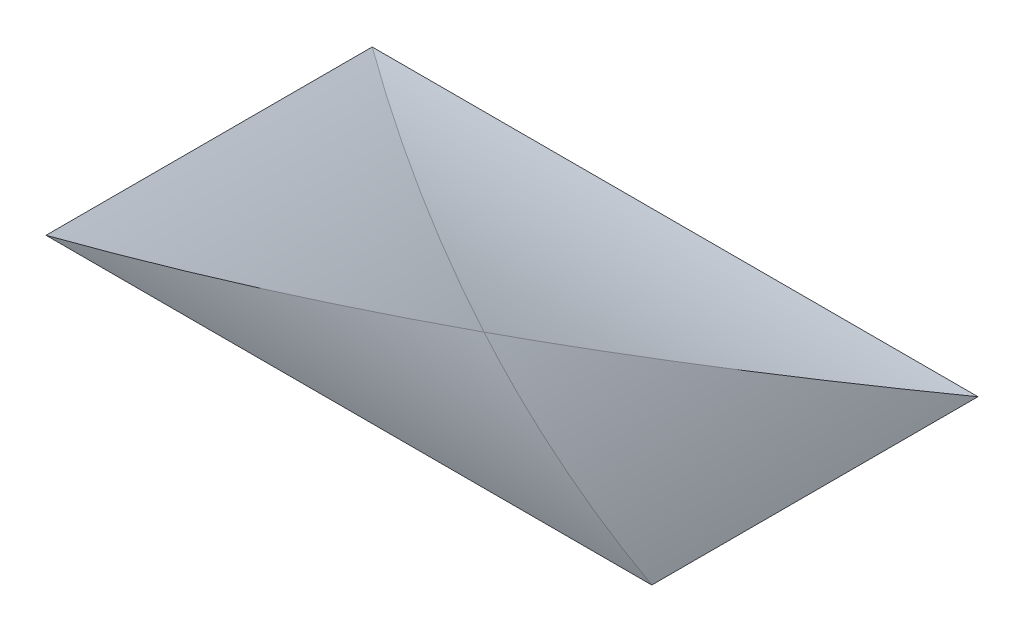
ISO-10303-21;
HEADER;
FILE_DESCRIPTION(('STEP AP214'),'2;1');
FILE_NAME('part.step','',(''),(''),'','','');
FILE_SCHEMA(('AUTOMOTIVE_DESIGN { 1 0 10303 214 1 1 1 1 }'));
ENDSEC;
DATA;
#1=APPLICATION_CONTEXT('core data for automotive mechanical design processes');
#2=APPLICATION_PROTOCOL_DEFINITION('international standard','automotive_design',2000,#1);
#3=PRODUCT_CONTEXT('',#1,'mechanical');
#4=PRODUCT('Part','Part','',(#3));
#5=PRODUCT_RELATED_PRODUCT_CATEGORY('part','',(#4));
#6=PRODUCT_DEFINITION_FORMATION('','',#4);
#7=PRODUCT_DEFINITION_CONTEXT('part definition',#1,'design');
#8=PRODUCT_DEFINITION('design','',#6,#7);
#9=PRODUCT_DEFINITION_SHAPE('','',#8);
#10=(LENGTH_UNIT() NAMED_UNIT(*) SI_UNIT(.MILLI.,.METRE.));
#11=(NAMED_UNIT(*) PLANE_ANGLE_UNIT() SI_UNIT($,.RADIAN.));
#12=(NAMED_UNIT(*) SI_UNIT($,.STERADIAN.) SOLID_ANGLE_UNIT());
#13=UNCERTAINTY_MEASURE_WITH_UNIT(LENGTH_MEASURE(1.E-05),#10,'distance_accuracy_value','');
#14=(GEOMETRIC_REPRESENTATION_CONTEXT(3) GLOBAL_UNCERTAINTY_ASSIGNED_CONTEXT((#13)) GLOBAL_UNIT_ASSIGNED_CONTEXT((#10,
#11,#12)) REPRESENTATION_CONTEXT('',''));
#15=CARTESIAN_POINT('',(0.,0.,0.));
#16=DIRECTION('',(0.,0.,1.));
#17=DIRECTION('',(1.,0.,0.));
#18=AXIS2_PLACEMENT_3D('',#15,#16,#17);
#19=CARTESIAN_POINT('',(650.,-1.11022302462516E-13,0.));
#20=DIRECTION('',(0.,0.,1.));
#21=DIRECTION('',(1.,0.,0.));
#22=AXIS2_PLACEMENT_3D('',#19,#20,#21);
#23=PLANE('',#22);
#24=DIRECTION('',(1.,0.,0.));
#25=VECTOR('',#24,1.);
#26=CARTESIAN_POINT('',(0.,0.,0.));
#27=LINE('',#26,#25);
#28=CARTESIAN_POINT('',(0.,0.,0.));
#29=VERTEX_POINT('',#28);
#30=CARTESIAN_POINT('',(650.,0.,0.));
#31=VERTEX_POINT('',#30);
#32=EDGE_CURVE('E111',#29,#31,#27,.T.);
#33=ORIENTED_EDGE('',*,*,#32,.F.);
#34=DIRECTION('',(-0.707106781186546,-0.707106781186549,0.));
#35=VECTOR('',#34,1.);
#36=CARTESIAN_POINT('',(0.,0.,0.));
#37=LINE('',#36,#35);
#38=CARTESIAN_POINT('',(349.999999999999,350.,0.));
#39=VERTEX_POINT('',#38);
#40=EDGE_CURVE('E13',#39,#29,#37,.T.);
#41=ORIENTED_EDGE('',*,*,#40,.F.);
#42=DIRECTION('',(-1.,0.,0.));
#43=VECTOR('',#42,1.);
#44=CARTESIAN_POINT('',(349.999999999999,350.,0.));
#45=LINE('',#44,#43);
#46=CARTESIAN_POINT('',(999.999999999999,350.,0.));
#47=VERTEX_POINT('',#46);
#48=EDGE_CURVE('E70',#47,#39,#45,.T.);
#49=ORIENTED_EDGE('',*,*,#48,.F.);
#50=DIRECTION('',(0.707106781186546,0.707106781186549,0.));
#51=VECTOR('',#50,1.);
#52=CARTESIAN_POINT('',(650.,0.,0.));
#53=LINE('',#52,#51);
#54=EDGE_CURVE('E78',#31,#47,#53,.T.);
#55=ORIENTED_EDGE('',*,*,#54,.F.);
#56=EDGE_LOOP('',(#33,#41,#49,#55));
#57=FACE_BOUND('',#56,.T.);
#58=ADVANCED_FACE('F55',(#57),#23,.F.);
#59=CARTESIAN_POINT('',(999.999999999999,350.,0.));
#60=CARTESIAN_POINT('',(993.303920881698,347.689202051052,0.799983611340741));
#61=CARTESIAN_POINT('',(979.915292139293,343.06490190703,2.36795148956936));
#62=CARTESIAN_POINT('',(959.84251396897,336.120663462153,4.62390527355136));
#63=CARTESIAN_POINT('',(939.779477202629,329.168961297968,6.78386102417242));
#64=CARTESIAN_POINT('',(919.725758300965,322.21011992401,8.84781874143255));
#65=CARTESIAN_POINT('',(899.680933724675,315.244463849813,10.8157784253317));
#66=CARTESIAN_POINT('',(879.644579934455,308.272317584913,12.68774007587));
#67=CARTESIAN_POINT('',(859.616273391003,301.294005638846,14.4637036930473));
#68=CARTESIAN_POINT('',(839.595590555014,294.309852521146,16.1436692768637));
#69=CARTESIAN_POINT('',(819.582107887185,287.320182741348,17.7276368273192));
#70=CARTESIAN_POINT('',(799.575401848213,280.325320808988,19.2156063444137));
#71=CARTESIAN_POINT('',(779.575048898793,273.325591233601,20.6075778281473));
#72=CARTESIAN_POINT('',(759.580625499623,266.321318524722,21.9035512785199));
#73=CARTESIAN_POINT('',(739.591708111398,259.312827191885,23.1035266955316));
#74=CARTESIAN_POINT('',(719.607873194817,252.300441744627,24.2075040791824));
#75=CARTESIAN_POINT('',(699.628697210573,245.284486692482,25.2154834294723));
#76=CARTESIAN_POINT('',(679.653756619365,238.265286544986,26.1274647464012));
#77=CARTESIAN_POINT('',(659.682627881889,231.243165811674,26.9434480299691));
#78=CARTESIAN_POINT('',(639.714887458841,224.21844900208,27.6634332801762));
#79=CARTESIAN_POINT('',(619.750111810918,217.19146062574,28.2874204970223));
#80=CARTESIAN_POINT('',(599.787877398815,210.162525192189,28.8154096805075));
#81=CARTESIAN_POINT('',(579.827760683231,203.131967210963,29.2474008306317));
#82=CARTESIAN_POINT('',(559.86933812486,196.100111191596,29.583393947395));
#83=CARTESIAN_POINT('',(539.912186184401,189.067281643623,29.8233890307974));
#84=CARTESIAN_POINT('',(519.955881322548,182.03380307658,29.9673860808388));
#85=CARTESIAN_POINT('',(506.651960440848,177.344601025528,29.9993854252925));
#86=CARTESIAN_POINT('',(499.999999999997,175.000000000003,29.9992063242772));
#87=CARTESIAN_POINT('',(945.833333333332,350.,0.));
#88=CARTESIAN_POINT('',(939.859099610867,347.690623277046,0.799983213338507));
#89=CARTESIAN_POINT('',(927.914206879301,343.068995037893,2.3679503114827));
#90=CARTESIAN_POINT('',(910.007162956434,336.128273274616,4.62390297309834));
#91=CARTESIAN_POINT('',(892.109985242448,329.179617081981,6.78385764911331));
#92=CARTESIAN_POINT('',(874.222244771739,322.223371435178,8.84781433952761));
#93=CARTESIAN_POINT('',(856.343512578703,315.259881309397,10.8157730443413));
#94=CARTESIAN_POINT('',(838.473359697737,308.289491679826,12.6877337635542));
#95=CARTESIAN_POINT('',(820.611357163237,301.312547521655,14.4636964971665));
#96=CARTESIAN_POINT('',(802.7570760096,294.329393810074,16.1436612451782));
#97=CARTESIAN_POINT('',(784.910087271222,287.340375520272,17.7276280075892));
#98=CARTESIAN_POINT('',(767.0699619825,280.345837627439,19.2155967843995));
#99=CARTESIAN_POINT('',(749.236271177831,273.346125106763,20.6075675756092));
#100=CARTESIAN_POINT('',(731.40858589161,266.341582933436,21.9035403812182));
#101=CARTESIAN_POINT('',(713.586477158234,259.332556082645,23.1035152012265));
#102=CARTESIAN_POINT('',(695.769516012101,252.31938952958,24.2074920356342));
#103=CARTESIAN_POINT('',(677.957273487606,245.302428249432,25.2154708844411));
#104=CARTESIAN_POINT('',(660.149320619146,238.282017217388,26.1274517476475));
#105=CARTESIAN_POINT('',(642.345228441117,231.25850140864,26.9434346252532));
#106=CARTESIAN_POINT('',(624.544567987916,224.232225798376,27.6634195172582));
#107=CARTESIAN_POINT('',(606.746910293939,217.203535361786,28.2874064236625));
#108=CARTESIAN_POINT('',(588.951826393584,210.172775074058,28.8153953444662));
#109=CARTESIAN_POINT('',(571.158887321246,203.140289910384,29.2473862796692));
#110=CARTESIAN_POINT('',(553.367664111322,196.106424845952,29.5833792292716));
#111=CARTESIAN_POINT('',(535.577727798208,189.071524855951,29.8233741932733));
#112=CARTESIAN_POINT('',(517.788649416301,182.035934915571,29.9673711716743));
#113=CARTESIAN_POINT('',(505.929549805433,177.345311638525,29.9993705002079));
#114=CARTESIAN_POINT('',(499.999999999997,175.000000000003,29.9992063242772));
#115=CARTESIAN_POINT('',(837.5,350.,0.));
#116=CARTESIAN_POINT('',(832.969457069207,347.693465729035,0.79998241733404));
#117=CARTESIAN_POINT('',(823.912036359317,343.077181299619,2.36794795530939));
#118=CARTESIAN_POINT('',(810.336460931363,336.143492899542,4.62389837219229));
#119=CARTESIAN_POINT('',(796.771001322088,329.200928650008,6.78385089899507));
#120=CARTESIAN_POINT('',(783.215217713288,322.249874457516,8.84780553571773));
#121=CARTESIAN_POINT('',(769.66867028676,315.290716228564,10.8157622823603));
#122=CARTESIAN_POINT('',(756.1309192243,308.323839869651,12.6877211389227));
#123=CARTESIAN_POINT('',(742.601524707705,301.349631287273,14.463682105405));
#124=CARTESIAN_POINT('',(729.080046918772,294.36847638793,16.1436451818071));
#125=CARTESIAN_POINT('',(715.566046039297,287.38076107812,17.7276103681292));
#126=CARTESIAN_POINT('',(702.059082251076,280.38687126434,19.2155776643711));
#127=CARTESIAN_POINT('',(688.558715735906,273.387192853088,20.6075470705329));
#128=CARTESIAN_POINT('',(675.064506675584,266.382111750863,21.9035185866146));
#129=CARTESIAN_POINT('',(661.576015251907,259.372013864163,23.1034922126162));
#130=CARTESIAN_POINT('',(648.092801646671,252.357285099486,24.2074679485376));
#131=CARTESIAN_POINT('',(634.614426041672,245.33831136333,25.2154457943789));
#132=CARTESIAN_POINT('',(621.140448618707,238.315478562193,26.1274257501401));
#133=CARTESIAN_POINT('',(607.670429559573,231.289172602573,26.9434078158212));
#134=CARTESIAN_POINT('',(594.203929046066,224.259779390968,27.6633919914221));
#135=CARTESIAN_POINT('',(580.740507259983,217.227684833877,28.287378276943));
#136=CARTESIAN_POINT('',(567.279724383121,210.193274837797,28.8153666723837));
#137=CARTESIAN_POINT('',(553.821140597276,203.156935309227,29.2473571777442));
#138=CARTESIAN_POINT('',(540.364316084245,196.119052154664,29.5833497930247));
#139=CARTESIAN_POINT('',(526.908811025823,189.080011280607,29.823344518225));
#140=CARTESIAN_POINT('',(513.454185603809,182.040198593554,29.9673413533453));
#141=CARTESIAN_POINT('',(504.484728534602,177.346732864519,29.9993406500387));
#142=CARTESIAN_POINT('',(499.999999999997,175.000000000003,29.9992063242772));
#143=CARTESIAN_POINT('',(674.999999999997,350.,0.));
#144=CARTESIAN_POINT('',(672.634993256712,347.697729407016,0.799981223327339));
#145=CARTESIAN_POINT('',(667.908780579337,343.089460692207,2.36794442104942));
#146=CARTESIAN_POINT('',(660.830407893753,336.166322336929,4.62389147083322));
#147=CARTESIAN_POINT('',(653.762525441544,329.232896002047,6.78384077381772));
#148=CARTESIAN_POINT('',(646.704677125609,322.289628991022,8.84779233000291));
#149=CARTESIAN_POINT('',(639.656406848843,315.336968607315,10.8157461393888));
#150=CARTESIAN_POINT('',(632.617258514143,308.375362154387,12.6877022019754));
#151=CARTESIAN_POINT('',(625.586776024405,301.4052569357,14.4636605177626));
#152=CARTESIAN_POINT('',(618.564503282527,294.427100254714,16.1436210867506));
#153=CARTESIAN_POINT('',(611.549984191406,287.441339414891,17.7275839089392));
#154=CARTESIAN_POINT('',(604.542762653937,280.448421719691,19.2155489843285));
#155=CARTESIAN_POINT('',(597.542382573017,273.448794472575,20.6075163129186));
#156=CARTESIAN_POINT('',(590.548387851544,266.442904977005,21.9034858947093));
#157=CARTESIAN_POINT('',(583.560322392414,259.431200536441,23.1034577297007));
#158=CARTESIAN_POINT('',(576.577730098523,252.414128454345,24.2074318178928));
#159=CARTESIAN_POINT('',(569.600154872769,245.392136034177,25.2154081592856));
#160=CARTESIAN_POINT('',(562.627140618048,238.365670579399,26.127386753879));
#161=CARTESIAN_POINT('',(555.658231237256,231.335179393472,26.9433676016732));
#162=CARTESIAN_POINT('',(548.692970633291,224.301109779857,27.6633507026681));
#163=CARTESIAN_POINT('',(541.730902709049,217.263909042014,28.2873360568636));
#164=CARTESIAN_POINT('',(534.771571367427,210.224024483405,28.8153236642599));
#165=CARTESIAN_POINT('',(527.814520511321,203.181903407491,29.2473135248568));
#166=CARTESIAN_POINT('',(520.859294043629,196.137993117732,29.5833056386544));
#167=CARTESIAN_POINT('',(513.905435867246,189.092740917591,29.8233000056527));
#168=CARTESIAN_POINT('',(506.95248988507,182.046594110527,29.9672966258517));
#169=CARTESIAN_POINT('',(502.317496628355,177.348864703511,29.9992958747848));
#170=CARTESIAN_POINT('',(499.999999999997,175.000000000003,29.9992063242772));
#171=CARTESIAN_POINT('',(512.499999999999,350.,0.));
#172=CARTESIAN_POINT('',(512.300529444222,347.701993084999,0.799980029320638));
#173=CARTESIAN_POINT('',(511.905524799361,343.101740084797,2.36794088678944));
#174=CARTESIAN_POINT('',(511.324354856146,336.189151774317,4.62388456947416));
#175=CARTESIAN_POINT('',(510.754049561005,329.264863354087,6.78383064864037));
#176=CARTESIAN_POINT('',(510.194136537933,322.329383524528,8.84777912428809));
#177=CARTESIAN_POINT('',(509.644143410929,315.383220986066,10.8157299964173));
#178=CARTESIAN_POINT('',(509.103597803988,308.426884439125,12.687683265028));
#179=CARTESIAN_POINT('',(508.572027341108,301.460882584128,14.4636389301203));
#180=CARTESIAN_POINT('',(508.048959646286,294.485724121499,16.143596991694));
#181=CARTESIAN_POINT('',(507.533922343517,287.501917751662,17.7275574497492));
#182=CARTESIAN_POINT('',(507.0264430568,280.509972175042,19.215520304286));
#183=CARTESIAN_POINT('',(506.526049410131,273.510396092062,20.6074855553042));
#184=CARTESIAN_POINT('',(506.032269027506,266.503698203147,21.903453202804));
#185=CARTESIAN_POINT('',(505.544629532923,259.490387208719,23.1034232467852));
#186=CARTESIAN_POINT('',(505.062658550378,252.470971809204,24.207395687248));
#187=CARTESIAN_POINT('',(504.585883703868,245.445960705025,25.2153705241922));
#188=CARTESIAN_POINT('',(504.11383261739,238.415862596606,26.127347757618));
#189=CARTESIAN_POINT('',(503.64603291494,231.381186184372,26.9433273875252));
#190=CARTESIAN_POINT('',(503.182012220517,224.342440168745,27.663309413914));
#191=CARTESIAN_POINT('',(502.721298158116,217.300133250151,28.2872938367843));
#192=CARTESIAN_POINT('',(502.263418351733,210.254774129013,28.8152806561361));
#193=CARTESIAN_POINT('',(501.807900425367,203.206871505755,29.2472698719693));
#194=CARTESIAN_POINT('',(501.354272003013,196.156934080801,29.5832614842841));
#195=CARTESIAN_POINT('',(500.902060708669,189.105470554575,29.8232554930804));
#196=CARTESIAN_POINT('',(500.450794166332,182.052989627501,29.9672518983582));
#197=CARTESIAN_POINT('',(500.150264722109,177.350996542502,29.999251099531));
#198=CARTESIAN_POINT('',(499.999999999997,175.000000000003,29.9992063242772));
#199=CARTESIAN_POINT('',(404.166666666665,350.,0.));
#200=CARTESIAN_POINT('',(405.41088690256,347.704835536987,0.79997923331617));
#201=CARTESIAN_POINT('',(407.903354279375,343.109926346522,2.36793853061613));
#202=CARTESIAN_POINT('',(411.653652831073,336.204371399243,4.62387996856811));
#203=CARTESIAN_POINT('',(415.415065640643,329.286174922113,6.78382389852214));
#204=CARTESIAN_POINT('',(419.187109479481,322.355886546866,8.84777032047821));
#205=CARTESIAN_POINT('',(422.969301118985,315.414055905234,10.8157192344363));
#206=CARTESIAN_POINT('',(426.76115733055,308.461232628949,12.6876706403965));
#207=CARTESIAN_POINT('',(430.562194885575,301.497966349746,14.4636245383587));
#208=CARTESIAN_POINT('',(434.371930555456,294.524806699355,16.143580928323));
#209=CARTESIAN_POINT('',(438.189881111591,287.54230330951,17.7275398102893));
#210=CARTESIAN_POINT('',(442.015563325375,280.551005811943,19.2155011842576));
#211=CARTESIAN_POINT('',(445.848493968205,273.551463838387,20.607465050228));
#212=CARTESIAN_POINT('',(449.68818981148,266.544227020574,21.9034314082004));
#213=CARTESIAN_POINT('',(453.534167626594,259.529844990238,23.1034002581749));
#214=CARTESIAN_POINT('',(457.385944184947,252.50886737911,24.2073716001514));
#215=CARTESIAN_POINT('',(461.243036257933,245.481843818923,25.21534543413));
#216=CARTESIAN_POINT('',(465.104960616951,238.449323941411,26.1273217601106));
#217=CARTESIAN_POINT('',(468.971234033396,231.411857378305,26.9433005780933));
#218=CARTESIAN_POINT('',(472.841373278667,224.369993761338,27.663281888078));
#219=CARTESIAN_POINT('',(476.714895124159,217.324282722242,28.2872656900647));
#220=CARTESIAN_POINT('',(480.59131634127,210.275273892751,28.8152519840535));
#221=CARTESIAN_POINT('',(484.470153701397,203.223516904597,29.2472407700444));
#222=CARTESIAN_POINT('',(488.350923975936,196.169561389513,29.5832320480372));
#223=CARTESIAN_POINT('',(492.233143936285,189.113956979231,29.8232258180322));
#224=CARTESIAN_POINT('',(496.116330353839,182.057253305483,29.9672220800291));
#225=CARTESIAN_POINT('',(498.705443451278,177.352417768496,29.9992212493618));
#226=CARTESIAN_POINT('',(499.999999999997,175.000000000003,29.9992063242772));
#227=CARTESIAN_POINT('',(349.999999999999,350.,0.));
#228=CARTESIAN_POINT('',(351.966065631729,347.706256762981,0.799978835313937));
#229=CARTESIAN_POINT('',(355.902269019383,343.114019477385,2.36793735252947));
#230=CARTESIAN_POINT('',(361.818301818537,336.211981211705,4.62387766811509));
#231=CARTESIAN_POINT('',(367.745573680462,329.296830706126,6.78382052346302));
#232=CARTESIAN_POINT('',(373.683595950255,322.369138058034,8.84776591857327));
#233=CARTESIAN_POINT('',(379.631879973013,315.429473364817,10.8157138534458));
#234=CARTESIAN_POINT('',(385.589937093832,308.478406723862,12.6876643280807));
#235=CARTESIAN_POINT('',(391.557278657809,301.516508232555,14.4636173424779));
#236=CARTESIAN_POINT('',(397.533416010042,294.544347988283,16.1435728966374));
#237=CARTESIAN_POINT('',(403.517860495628,287.562496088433,17.7275309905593));
#238=CARTESIAN_POINT('',(409.510123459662,280.571522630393,19.2154916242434));
#239=CARTESIAN_POINT('',(415.509716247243,273.571997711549,20.6074547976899));
#240=CARTESIAN_POINT('',(421.516150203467,266.564491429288,21.9034205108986));
#241=CARTESIAN_POINT('',(427.52893667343,259.549573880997,23.1033887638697));
#242=CARTESIAN_POINT('',(433.547587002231,252.527815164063,24.2073595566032));
#243=CARTESIAN_POINT('',(439.571612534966,245.499785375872,25.2153328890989));
#244=CARTESIAN_POINT('',(445.600524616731,238.466054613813,26.1273087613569));
#245=CARTESIAN_POINT('',(451.633834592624,231.427192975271,26.9432871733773));
#246=CARTESIAN_POINT('',(457.671053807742,224.383770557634,27.66326812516));
#247=CARTESIAN_POINT('',(463.711693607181,217.336357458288,28.2872516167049));
#248=CARTESIAN_POINT('',(469.755265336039,210.285523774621,28.8152376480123));
#249=CARTESIAN_POINT('',(475.801280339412,203.231839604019,29.2472262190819));
#250=CARTESIAN_POINT('',(481.849249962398,196.175875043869,29.5832173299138));
#251=CARTESIAN_POINT('',(487.898685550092,189.118200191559,29.8232109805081));
#252=CARTESIAN_POINT('',(493.949098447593,182.059385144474,29.9672071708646));
#253=CARTESIAN_POINT('',(497.983032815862,177.353128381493,29.9992063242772));
#254=CARTESIAN_POINT('',(499.999999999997,175.000000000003,29.9992063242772));
#255=B_SPLINE_SURFACE_WITH_KNOTS('',3,3,((#59,#60,#61,#62,#63,#64,#65,#66,#67,#68,#69,#70,#71,
#72,#73,#74,#75,#76,#77,#78,#79,#80,#81,#82,#83,#84,#85,#86),(#87,#88,#89,#90,#91,#92,#93,#94,
#95,#96,#97,#98,#99,#100,#101,#102,#103,#104,#105,#106,#107,#108,#109,#110,#111,#112,#113,#114),
(#115,#116,#117,#118,#119,#120,#121,#122,#123,#124,#125,#126,#127,#128,#129,#130,#131,#132,#133,
#134,#135,#136,#137,#138,#139,#140,#141,#142),(#143,#144,#145,#146,#147,#148,#149,#150,#151,
#152,#153,#154,#155,#156,#157,#158,#159,#160,#161,#162,#163,#164,#165,#166,#167,#168,#169,#170),
(#171,#172,#173,#174,#175,#176,#177,#178,#179,#180,#181,#182,#183,#184,#185,#186,#187,#188,#189,
#190,#191,#192,#193,#194,#195,#196,#197,#198),(#199,#200,#201,#202,#203,#204,#205,#206,#207,
#208,#209,#210,#211,#212,#213,#214,#215,#216,#217,#218,#219,#220,#221,#222,#223,#224,#225,#226),
(#227,#228,#229,#230,#231,#232,#233,#234,#235,#236,#237,#238,#239,#240,#241,#242,#243,#244,#245,
#246,#247,#248,#249,#250,#251,#252,#253,#254)),.UNSPECIFIED.,.F.,.F.,.F.,(4,1,1,1,4),(4,1,1,1,1,
1,1,1,1,1,1,1,1,1,1,1,1,1,1,1,1,1,1,1,1,4),(0.637877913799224,0.728408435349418,
0.818938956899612,0.909469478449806,1.),(0.,0.04,0.08,0.12,0.16,0.2,0.24,0.28,0.32,0.36,0.4,
0.44,0.48,0.52,0.56,0.6,0.64,0.68,0.72,0.76,0.8,0.84,0.88,0.92,0.96,1.),.UNSPECIFIED.);
#256=CARTESIAN_POINT('',(349.999999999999,350.,0.));
#257=CARTESIAN_POINT('',(351.966065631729,347.706256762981,0.799978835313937));
#258=CARTESIAN_POINT('',(355.902269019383,343.114019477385,2.36793735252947));
#259=CARTESIAN_POINT('',(361.818301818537,336.211981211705,4.62387766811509));
#260=CARTESIAN_POINT('',(367.745573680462,329.296830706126,6.78382052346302));
#261=CARTESIAN_POINT('',(373.683595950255,322.369138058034,8.84776591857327));
#262=CARTESIAN_POINT('',(379.631879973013,315.429473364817,10.8157138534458));
#263=CARTESIAN_POINT('',(385.589937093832,308.478406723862,12.6876643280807));
#264=CARTESIAN_POINT('',(391.557278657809,301.516508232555,14.4636173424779));
#265=CARTESIAN_POINT('',(397.533416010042,294.544347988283,16.1435728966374));
#266=CARTESIAN_POINT('',(403.517860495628,287.562496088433,17.7275309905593));
#267=CARTESIAN_POINT('',(409.510123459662,280.571522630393,19.2154916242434));
#268=CARTESIAN_POINT('',(415.509716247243,273.571997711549,20.6074547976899));
#269=CARTESIAN_POINT('',(421.516150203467,266.564491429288,21.9034205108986));
#270=CARTESIAN_POINT('',(427.52893667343,259.549573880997,23.1033887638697));
#271=CARTESIAN_POINT('',(433.547587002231,252.527815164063,24.2073595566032));
#272=CARTESIAN_POINT('',(439.571612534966,245.499785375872,25.2153328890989));
#273=CARTESIAN_POINT('',(445.600524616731,238.466054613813,26.1273087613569));
#274=CARTESIAN_POINT('',(451.633834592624,231.427192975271,26.9432871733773));
#275=CARTESIAN_POINT('',(457.671053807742,224.383770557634,27.66326812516));
#276=CARTESIAN_POINT('',(463.711693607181,217.336357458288,28.2872516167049));
#277=CARTESIAN_POINT('',(469.755265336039,210.285523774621,28.8152376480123));
#278=CARTESIAN_POINT('',(475.801280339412,203.231839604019,29.2472262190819));
#279=CARTESIAN_POINT('',(481.849249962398,196.175875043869,29.5832173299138));
#280=CARTESIAN_POINT('',(487.898685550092,189.118200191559,29.8232109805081));
#281=CARTESIAN_POINT('',(493.949098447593,182.059385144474,29.9672071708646));
#282=CARTESIAN_POINT('',(497.983032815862,177.353128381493,29.9992063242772));
#283=CARTESIAN_POINT('',(499.999999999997,175.000000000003,29.9992063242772));
#284=B_SPLINE_CURVE_WITH_KNOTS('',3,(#256,#257,#258,#259,#260,#261,#262,#263,#264,#265,#266,
#267,#268,#269,#270,#271,#272,#273,#274,#275,#276,#277,#278,#279,#280,#281,#282,#283),
.UNSPECIFIED.,.F.,.F.,(4,1,1,1,1,1,1,1,1,1,1,1,1,1,1,1,1,1,1,1,1,1,1,1,1,4),(0.,0.04,0.08,0.12,
0.16,0.2,0.24,0.28,0.32,0.36,0.4,0.44,0.48,0.52,0.56,0.6,0.64,0.68,0.72,0.76,0.8,0.84,0.88,0.92,
0.96,1.),.UNSPECIFIED.);
#285=CARTESIAN_POINT('',(499.999999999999,175.000000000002,29.9994536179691));
#286=VERTEX_POINT('',#285);
#287=EDGE_CURVE('E97',#39,#286,#284,.T.);
#288=CARTESIAN_POINT('',(999.999999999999,350.,0.));
#289=CARTESIAN_POINT('',(993.303920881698,347.689202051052,0.799983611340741));
#290=CARTESIAN_POINT('',(979.915292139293,343.06490190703,2.36795148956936));
#291=CARTESIAN_POINT('',(959.84251396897,336.120663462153,4.62390527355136));
#292=CARTESIAN_POINT('',(939.779477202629,329.168961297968,6.78386102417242));
#293=CARTESIAN_POINT('',(919.725758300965,322.21011992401,8.84781874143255));
#294=CARTESIAN_POINT('',(899.680933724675,315.244463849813,10.8157784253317));
#295=CARTESIAN_POINT('',(879.644579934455,308.272317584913,12.68774007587));
#296=CARTESIAN_POINT('',(859.616273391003,301.294005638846,14.4637036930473));
#297=CARTESIAN_POINT('',(839.595590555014,294.309852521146,16.1436692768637));
#298=CARTESIAN_POINT('',(819.582107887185,287.320182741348,17.7276368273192));
#299=CARTESIAN_POINT('',(799.575401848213,280.325320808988,19.2156063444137));
#300=CARTESIAN_POINT('',(779.575048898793,273.325591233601,20.6075778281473));
#301=CARTESIAN_POINT('',(759.580625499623,266.321318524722,21.9035512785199));
#302=CARTESIAN_POINT('',(739.591708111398,259.312827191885,23.1035266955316));
#303=CARTESIAN_POINT('',(719.607873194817,252.300441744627,24.2075040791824));
#304=CARTESIAN_POINT('',(699.628697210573,245.284486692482,25.2154834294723));
#305=CARTESIAN_POINT('',(679.653756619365,238.265286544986,26.1274647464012));
#306=CARTESIAN_POINT('',(659.682627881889,231.243165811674,26.9434480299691));
#307=CARTESIAN_POINT('',(639.714887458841,224.21844900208,27.6634332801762));
#308=CARTESIAN_POINT('',(619.750111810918,217.19146062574,28.2874204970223));
#309=CARTESIAN_POINT('',(599.787877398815,210.162525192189,28.8154096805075));
#310=CARTESIAN_POINT('',(579.827760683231,203.131967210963,29.2474008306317));
#311=CARTESIAN_POINT('',(559.86933812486,196.100111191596,29.583393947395));
#312=CARTESIAN_POINT('',(539.912186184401,189.067281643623,29.8233890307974));
#313=CARTESIAN_POINT('',(519.955881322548,182.03380307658,29.9673860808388));
#314=CARTESIAN_POINT('',(506.651960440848,177.344601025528,29.9993854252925));
#315=CARTESIAN_POINT('',(499.999999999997,175.000000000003,29.9992063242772));
#316=B_SPLINE_CURVE_WITH_KNOTS('',3,(#288,#289,#290,#291,#292,#293,#294,#295,#296,#297,#298,
#299,#300,#301,#302,#303,#304,#305,#306,#307,#308,#309,#310,#311,#312,#313,#314,#315),
.UNSPECIFIED.,.F.,.F.,(4,1,1,1,1,1,1,1,1,1,1,1,1,1,1,1,1,1,1,1,1,1,1,1,1,4),(0.,0.04,0.08,0.12,
0.16,0.2,0.24,0.28,0.32,0.36,0.4,0.44,0.48,0.52,0.56,0.6,0.64,0.68,0.72,0.76,0.8,0.84,0.88,0.92,
0.96,1.),.UNSPECIFIED.);
#317=EDGE_CURVE('E109',#47,#286,#316,.T.);
#318=ORIENTED_EDGE('',*,*,#48,.T.);
#319=ORIENTED_EDGE('',*,*,#287,.T.);
#320=ORIENTED_EDGE('',*,*,#317,.F.);
#321=EDGE_LOOP('',(#318,#319,#320));
#322=FACE_BOUND('',#321,.T.);
#323=ADVANCED_FACE('F108',(#322),#255,.T.);
#324=CARTESIAN_POINT('',(650.,0.,0.));
#325=CARTESIAN_POINT('',(647.974030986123,2.34288156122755,0.799987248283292));
#326=CARTESIAN_POINT('',(643.925209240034,7.02749889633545,2.36796225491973));
#327=CARTESIAN_POINT('',(637.860951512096,14.0511250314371,4.62392629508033));
#328=CARTESIAN_POINT('',(631.805294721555,21.0715887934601,6.78389186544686));
#329=CARTESIAN_POINT('',(625.75786491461,28.0890276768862,8.84785896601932));
#330=CARTESIAN_POINT('',(619.718288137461,35.1035791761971,10.8158275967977));
#331=CARTESIAN_POINT('',(613.686190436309,42.1153807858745,12.687797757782));
#332=CARTESIAN_POINT('',(607.661197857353,49.1245700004,14.4637694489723));
#333=CARTESIAN_POINT('',(601.642936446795,56.1312843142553,16.1437426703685));
#334=CARTESIAN_POINT('',(595.631032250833,63.135661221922,17.7277174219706));
#335=CARTESIAN_POINT('',(589.62511131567,70.137838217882,19.2156937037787));
#336=CARTESIAN_POINT('',(583.624799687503,77.1379527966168,20.6076715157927));
#337=CARTESIAN_POINT('',(577.629723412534,84.1361424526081,21.9036508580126));
#338=CARTESIAN_POINT('',(571.639508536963,91.1325446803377,23.1036317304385));
#339=CARTESIAN_POINT('',(565.65378110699,98.127296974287,24.2076141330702));
#340=CARTESIAN_POINT('',(559.672167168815,105.120536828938,25.215598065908));
#341=CARTESIAN_POINT('',(553.694292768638,112.112401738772,26.1275835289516));
#342=CARTESIAN_POINT('',(547.71978395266,119.103029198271,26.9435705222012));
#343=CARTESIAN_POINT('',(541.74826676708,126.092556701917,27.6635590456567));
#344=CARTESIAN_POINT('',(535.7793672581,133.081121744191,28.2875490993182));
#345=CARTESIAN_POINT('',(529.812711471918,140.068861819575,28.8155406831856));
#346=CARTESIAN_POINT('',(523.847925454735,147.05591442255,29.2475337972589));
#347=CARTESIAN_POINT('',(517.884635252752,154.042417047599,29.5835284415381));
#348=CARTESIAN_POINT('',(511.922466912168,161.028507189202,29.8235246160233));
#349=CARTESIAN_POINT('',(505.961046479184,168.014322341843,29.9675223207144));
#350=CARTESIAN_POINT('',(501.987015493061,172.671440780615,29.9995218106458));
#351=CARTESIAN_POINT('',(499.999999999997,175.000000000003,29.9992063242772));
#352=CARTESIAN_POINT('',(679.166666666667,29.1666666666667,0.));
#353=CARTESIAN_POINT('',(676.751521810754,31.1217416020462,0.799986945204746));
#354=CARTESIAN_POINT('',(671.924382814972,35.0306158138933,2.3679613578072));
#355=CARTESIAN_POINT('',(664.692748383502,40.8902532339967,4.62392454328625));
#356=CARTESIAN_POINT('',(657.469809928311,46.7463698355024,6.78388929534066));
#357=CARTESIAN_POINT('',(650.255189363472,52.5991186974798,8.84785561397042));
#358=CARTESIAN_POINT('',(643.048508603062,58.4486528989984,10.8158234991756));
#359=CARTESIAN_POINT('',(635.849389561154,64.2951255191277,12.687792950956));
#360=CARTESIAN_POINT('',(628.657454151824,70.1386896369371,14.4637639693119));
#361=CARTESIAN_POINT('',(621.472324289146,75.9794983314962,16.1437365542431));
#362=CARTESIAN_POINT('',(614.293621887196,81.8177046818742,17.7277107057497));
#363=CARTESIAN_POINT('',(607.120968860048,87.6534617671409,19.2156864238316));
#364=CARTESIAN_POINT('',(599.953987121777,93.4869226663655,20.6076637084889));
#365=CARTESIAN_POINT('',(592.792298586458,99.3182404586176,21.9036425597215));
#366=CARTESIAN_POINT('',(585.635525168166,105.147568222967,23.1036229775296));
#367=CARTESIAN_POINT('',(578.483288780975,110.975059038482,24.2076049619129));
#368=CARTESIAN_POINT('',(571.335211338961,116.800865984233,25.2155885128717));
#369=CARTESIAN_POINT('',(564.190914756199,122.62514213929,26.1275736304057));
#370=CARTESIAN_POINT('',(557.050020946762,128.448040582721,26.9435603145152));
#371=CARTESIAN_POINT('',(549.912151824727,134.269714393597,27.6635485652));
#372=CARTESIAN_POINT('',(542.776929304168,140.090316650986,28.2875383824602));
#373=CARTESIAN_POINT('',(535.643975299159,145.910000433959,28.8155297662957));
#374=CARTESIAN_POINT('',(528.512911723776,151.728918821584,29.2475227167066));
#375=CARTESIAN_POINT('',(521.383360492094,157.547224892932,29.5835172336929));
#376=CARTESIAN_POINT('',(514.254943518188,163.365071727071,29.8235133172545));
#377=CARTESIAN_POINT('',(507.127282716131,169.182612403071,29.9675109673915));
#378=CARTESIAN_POINT('',(502.375760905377,173.060870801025,29.9995104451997));
#379=CARTESIAN_POINT('',(499.999999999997,175.000000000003,29.9992063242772));
#380=CARTESIAN_POINT('',(737.499999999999,87.4999999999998,0.));
#381=CARTESIAN_POINT('',(734.306503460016,88.6794616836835,0.799986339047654));
#382=CARTESIAN_POINT('',(727.922729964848,91.0368496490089,2.36795956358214));
#383=CARTESIAN_POINT('',(718.356342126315,94.568509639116,4.62392103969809));
#384=CARTESIAN_POINT('',(708.798840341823,98.095931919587,6.78388415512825));
#385=CARTESIAN_POINT('',(699.249838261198,101.619300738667,8.84784890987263));
#386=CARTESIAN_POINT('',(689.708949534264,105.138800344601,10.8158153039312));
#387=CARTESIAN_POINT('',(680.175787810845,108.654614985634,12.687783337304));
#388=CARTESIAN_POINT('',(670.649966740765,112.166928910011,14.4637530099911));
#389=CARTESIAN_POINT('',(661.131099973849,115.675926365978,16.1437243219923));
#390=CARTESIAN_POINT('',(651.618801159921,119.181791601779,17.7276972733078));
#391=CARTESIAN_POINT('',(642.112683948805,122.684708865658,19.2156718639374));
#392=CARTESIAN_POINT('',(632.612361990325,126.184862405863,20.6076480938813));
#393=CARTESIAN_POINT('',(623.117448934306,129.682436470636,21.9036259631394));
#394=CARTESIAN_POINT('',(613.627558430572,133.177615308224,23.1036054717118));
#395=CARTESIAN_POINT('',(604.142304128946,136.670583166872,24.2075866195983));
#396=CARTESIAN_POINT('',(594.661299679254,140.161524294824,25.215569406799));
#397=CARTESIAN_POINT('',(585.18415873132,143.650622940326,26.127553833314));
#398=CARTESIAN_POINT('',(575.710494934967,147.138063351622,26.9435398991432));
#399=CARTESIAN_POINT('',(566.23992194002,150.624029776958,27.6635276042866));
#400=CARTESIAN_POINT('',(556.772053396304,154.108706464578,28.2875169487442));
#401=CARTESIAN_POINT('',(547.306502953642,157.592277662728,28.815507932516));
#402=CARTESIAN_POINT('',(537.842884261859,161.074927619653,29.2475005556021));
#403=CARTESIAN_POINT('',(528.380810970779,164.556840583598,29.5834948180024));
#404=CARTESIAN_POINT('',(518.919896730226,168.038200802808,29.8234907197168));
#405=CARTESIAN_POINT('',(509.459755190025,171.519192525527,29.9674882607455));
#406=CARTESIAN_POINT('',(503.153251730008,173.839730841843,29.9994877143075));
#407=CARTESIAN_POINT('',(499.999999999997,175.000000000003,29.9992063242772));
#408=CARTESIAN_POINT('',(825.,175.,0.));
#409=CARTESIAN_POINT('',(820.638975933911,175.01604180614,0.799985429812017));
#410=CARTESIAN_POINT('',(811.920250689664,175.046200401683,2.36795687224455));
#411=CARTESIAN_POINT('',(798.851732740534,175.085894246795,4.62391578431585));
#412=CARTESIAN_POINT('',(785.792385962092,175.120275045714,6.78387644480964));
#413=CARTESIAN_POINT('',(772.741811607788,175.149573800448,8.84783885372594));
#414=CARTESIAN_POINT('',(759.699610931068,175.174021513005,10.8158030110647));
#415=CARTESIAN_POINT('',(746.665385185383,175.193849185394,12.687768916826));
#416=CARTESIAN_POINT('',(733.638735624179,175.209287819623,14.4637365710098));
#417=CARTESIAN_POINT('',(720.619263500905,175.220568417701,16.1437059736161));
#418=CARTESIAN_POINT('',(707.60657006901,175.227921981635,17.7276771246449));
#419=CARTESIAN_POINT('',(694.600256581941,175.231579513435,19.2156500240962));
#420=CARTESIAN_POINT('',(681.599924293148,175.231772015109,20.60762467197));
#421=CARTESIAN_POINT('',(668.605174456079,175.228730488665,21.9036010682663));
#422=CARTESIAN_POINT('',(655.615608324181,175.222685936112,23.103579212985));
#423=CARTESIAN_POINT('',(642.630827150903,175.213869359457,24.2075591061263));
#424=CARTESIAN_POINT('',(629.650432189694,175.20251176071,25.2155407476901));
#425=CARTESIAN_POINT('',(616.674024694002,175.188844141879,26.1275241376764));
#426=CARTESIAN_POINT('',(603.701205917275,175.173097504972,26.9435092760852));
#427=CARTESIAN_POINT('',(590.731577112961,175.155502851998,27.6634961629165));
#428=CARTESIAN_POINT('',(577.764739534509,175.136291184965,28.2874847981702));
#429=CARTESIAN_POINT('',(564.800294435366,175.115693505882,28.8154751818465));
#430=CARTESIAN_POINT('',(551.837843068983,175.093940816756,29.2474673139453));
#431=CARTESIAN_POINT('',(538.876986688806,175.071264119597,29.5834611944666));
#432=CARTESIAN_POINT('',(525.917326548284,175.047894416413,29.8234568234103));
#433=CARTESIAN_POINT('',(512.958463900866,175.024062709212,29.9674542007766));
#434=CARTESIAN_POINT('',(504.319487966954,175.008020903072,29.9994536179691));
#435=CARTESIAN_POINT('',(499.999999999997,175.000000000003,29.9992063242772));
#436=CARTESIAN_POINT('',(912.499999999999,262.5,0.));
#437=CARTESIAN_POINT('',(906.971448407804,261.352621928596,0.799984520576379));
#438=CARTESIAN_POINT('',(895.917771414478,259.055551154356,2.36795418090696));
#439=CARTESIAN_POINT('',(879.347123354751,255.603278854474,4.6239105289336));
#440=CARTESIAN_POINT('',(862.78593158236,252.144618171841,6.78386873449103));
#441=CARTESIAN_POINT('',(846.233784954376,248.679846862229,8.84782879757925));
#442=CARTESIAN_POINT('',(829.690272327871,245.209242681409,10.8157907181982));
#443=CARTESIAN_POINT('',(813.154982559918,241.733083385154,12.687754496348));
#444=CARTESIAN_POINT('',(796.62750450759,238.251646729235,14.4637201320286));
#445=CARTESIAN_POINT('',(780.107427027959,234.765210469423,16.1436876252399));
#446=CARTESIAN_POINT('',(763.594338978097,231.274052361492,17.727656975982));
#447=CARTESIAN_POINT('',(747.087829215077,227.778450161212,19.2156281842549));
#448=CARTESIAN_POINT('',(730.587486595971,224.278681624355,20.6076012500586));
#449=CARTESIAN_POINT('',(714.092899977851,220.775024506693,21.9035761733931));
#450=CARTESIAN_POINT('',(697.60365821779,217.267756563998,23.1035529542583));
#451=CARTESIAN_POINT('',(681.11935017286,213.757155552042,24.2075315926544));
#452=CARTESIAN_POINT('',(664.639564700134,210.243499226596,25.2155120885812));
#453=CARTESIAN_POINT('',(648.163890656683,206.727065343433,26.1274944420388));
#454=CARTESIAN_POINT('',(631.691916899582,203.208131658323,26.9434786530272));
#455=CARTESIAN_POINT('',(615.223232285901,199.686975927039,27.6634647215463));
#456=CARTESIAN_POINT('',(598.757425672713,196.163875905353,28.2874526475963));
#457=CARTESIAN_POINT('',(582.294085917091,192.639109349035,28.815442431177));
#458=CARTESIAN_POINT('',(565.832801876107,189.11295401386,29.2474340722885));
#459=CARTESIAN_POINT('',(549.373162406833,185.585687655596,29.5834275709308));
#460=CARTESIAN_POINT('',(532.914756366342,182.057588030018,29.8234229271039));
#461=CARTESIAN_POINT('',(516.457172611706,178.528932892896,29.9674201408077));
#462=CARTESIAN_POINT('',(505.485724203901,176.1763109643,29.9994195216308));
#463=CARTESIAN_POINT('',(499.999999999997,175.000000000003,29.9992063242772));
#464=CARTESIAN_POINT('',(970.833333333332,320.833333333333,0.));
#465=CARTESIAN_POINT('',(964.526430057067,318.910342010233,0.799983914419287));
#466=CARTESIAN_POINT('',(951.916118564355,315.061784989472,2.36795238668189));
#467=CARTESIAN_POINT('',(933.010717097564,309.281535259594,4.62390702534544));
#468=CARTESIAN_POINT('',(914.114961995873,303.494180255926,6.78386359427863));
#469=CARTESIAN_POINT('',(895.228433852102,297.700028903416,8.84782209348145));
#470=CARTESIAN_POINT('',(876.350713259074,291.899390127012,10.8157825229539));
#471=CARTESIAN_POINT('',(857.48138080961,286.09257285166,12.687744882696));
#472=CARTESIAN_POINT('',(838.620017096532,280.279886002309,14.4637091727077));
#473=CARTESIAN_POINT('',(819.766202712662,274.461638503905,16.1436753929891));
#474=CARTESIAN_POINT('',(800.919518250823,268.638139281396,17.7276435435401));
#475=CARTESIAN_POINT('',(782.079544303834,262.809697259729,19.2156136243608));
#476=CARTESIAN_POINT('',(763.245861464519,256.976621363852,20.6075856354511));
#477=CARTESIAN_POINT('',(744.418050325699,251.139220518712,21.903559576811));
#478=CARTESIAN_POINT('',(725.595691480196,245.297803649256,23.1035354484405));
#479=CARTESIAN_POINT('',(706.778365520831,239.452679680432,24.2075132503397));
#480=CARTESIAN_POINT('',(687.965653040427,233.604157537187,25.2154929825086));
#481=CARTESIAN_POINT('',(669.157134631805,227.752546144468,26.127474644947));
#482=CARTESIAN_POINT('',(650.352390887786,221.898154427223,26.9434582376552));
#483=CARTESIAN_POINT('',(631.551002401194,216.0412913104,27.6634437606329));
#484=CARTESIAN_POINT('',(612.752549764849,210.182265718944,28.2874312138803));
#485=CARTESIAN_POINT('',(593.956613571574,204.321386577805,28.8154205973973));
#486=CARTESIAN_POINT('',(575.162774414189,198.458962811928,29.247411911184));
#487=CARTESIAN_POINT('',(556.370612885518,192.595303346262,29.5834051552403));
#488=CARTESIAN_POINT('',(537.579709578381,186.730717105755,29.8234003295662));
#489=CARTESIAN_POINT('',(518.789645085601,180.865513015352,29.9673974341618));
#490=CARTESIAN_POINT('',(506.263215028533,176.955171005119,29.9993967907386));
#491=CARTESIAN_POINT('',(499.999999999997,175.000000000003,29.9992063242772));
#492=CARTESIAN_POINT('',(999.999999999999,350.,0.));
#493=CARTESIAN_POINT('',(993.303920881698,347.689202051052,0.799983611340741));
#494=CARTESIAN_POINT('',(979.915292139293,343.06490190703,2.36795148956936));
#495=CARTESIAN_POINT('',(959.84251396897,336.120663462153,4.62390527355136));
#496=CARTESIAN_POINT('',(939.779477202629,329.168961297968,6.78386102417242));
#497=CARTESIAN_POINT('',(919.725758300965,322.21011992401,8.84781874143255));
#498=CARTESIAN_POINT('',(899.680933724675,315.244463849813,10.8157784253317));
#499=CARTESIAN_POINT('',(879.644579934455,308.272317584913,12.68774007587));
#500=CARTESIAN_POINT('',(859.616273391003,301.294005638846,14.4637036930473));
#501=CARTESIAN_POINT('',(839.595590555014,294.309852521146,16.1436692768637));
#502=CARTESIAN_POINT('',(819.582107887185,287.320182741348,17.7276368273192));
#503=CARTESIAN_POINT('',(799.575401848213,280.325320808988,19.2156063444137));
#504=CARTESIAN_POINT('',(779.575048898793,273.325591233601,20.6075778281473));
#505=CARTESIAN_POINT('',(759.580625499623,266.321318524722,21.9035512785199));
#506=CARTESIAN_POINT('',(739.591708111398,259.312827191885,23.1035266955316));
#507=CARTESIAN_POINT('',(719.607873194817,252.300441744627,24.2075040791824));
#508=CARTESIAN_POINT('',(699.628697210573,245.284486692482,25.2154834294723));
#509=CARTESIAN_POINT('',(679.653756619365,238.265286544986,26.1274647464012));
#510=CARTESIAN_POINT('',(659.682627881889,231.243165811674,26.9434480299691));
#511=CARTESIAN_POINT('',(639.714887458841,224.21844900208,27.6634332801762));
#512=CARTESIAN_POINT('',(619.750111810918,217.19146062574,28.2874204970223));
#513=CARTESIAN_POINT('',(599.787877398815,210.162525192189,28.8154096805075));
#514=CARTESIAN_POINT('',(579.827760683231,203.131967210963,29.2474008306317));
#515=CARTESIAN_POINT('',(559.86933812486,196.100111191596,29.583393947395));
#516=CARTESIAN_POINT('',(539.912186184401,189.067281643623,29.8233890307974));
#517=CARTESIAN_POINT('',(519.955881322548,182.03380307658,29.9673860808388));
#518=CARTESIAN_POINT('',(506.651960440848,177.344601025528,29.9993854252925));
#519=CARTESIAN_POINT('',(499.999999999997,175.000000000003,29.9992063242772));
#520=B_SPLINE_SURFACE_WITH_KNOTS('',3,3,((#324,#325,#326,#327,#328,#329,#330,#331,#332,#333,
#334,#335,#336,#337,#338,#339,#340,#341,#342,#343,#344,#345,#346,#347,#348,#349,#350,#351),
(#352,#353,#354,#355,#356,#357,#358,#359,#360,#361,#362,#363,#364,#365,#366,#367,#368,#369,#370,
#371,#372,#373,#374,#375,#376,#377,#378,#379),(#380,#381,#382,#383,#384,#385,#386,#387,#388,
#389,#390,#391,#392,#393,#394,#395,#396,#397,#398,#399,#400,#401,#402,#403,#404,#405,#406,#407),
(#408,#409,#410,#411,#412,#413,#414,#415,#416,#417,#418,#419,#420,#421,#422,#423,#424,#425,#426,
#427,#428,#429,#430,#431,#432,#433,#434,#435),(#436,#437,#438,#439,#440,#441,#442,#443,#444,
#445,#446,#447,#448,#449,#450,#451,#452,#453,#454,#455,#456,#457,#458,#459,#460,#461,#462,#463),
(#464,#465,#466,#467,#468,#469,#470,#471,#472,#473,#474,#475,#476,#477,#478,#479,#480,#481,#482,
#483,#484,#485,#486,#487,#488,#489,#490,#491),(#492,#493,#494,#495,#496,#497,#498,#499,#500,
#501,#502,#503,#504,#505,#506,#507,#508,#509,#510,#511,#512,#513,#514,#515,#516,#517,#518,
#519)),.UNSPECIFIED.,.F.,.F.,.F.,(4,1,1,1,4),(4,1,1,1,1,1,1,1,1,1,1,1,1,1,1,1,1,1,1,1,1,1,1,1,1,
4),(0.362122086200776,0.431061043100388,0.5,0.568938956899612,0.637877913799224),(0.,0.04,0.08,
0.12,0.16,0.2,0.24,0.28,0.32,0.36,0.4,0.44,0.48,0.52,0.56,0.6,0.64,0.68,0.72,0.76,0.8,0.84,0.88,
0.92,0.96,1.),.UNSPECIFIED.);
#521=CARTESIAN_POINT('',(650.,0.,0.));
#522=CARTESIAN_POINT('',(647.974030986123,2.34288156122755,0.799987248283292));
#523=CARTESIAN_POINT('',(643.925209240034,7.02749889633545,2.36796225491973));
#524=CARTESIAN_POINT('',(637.860951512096,14.0511250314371,4.62392629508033));
#525=CARTESIAN_POINT('',(631.805294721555,21.0715887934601,6.78389186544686));
#526=CARTESIAN_POINT('',(625.75786491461,28.0890276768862,8.84785896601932));
#527=CARTESIAN_POINT('',(619.718288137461,35.1035791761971,10.8158275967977));
#528=CARTESIAN_POINT('',(613.686190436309,42.1153807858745,12.687797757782));
#529=CARTESIAN_POINT('',(607.661197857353,49.1245700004,14.4637694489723));
#530=CARTESIAN_POINT('',(601.642936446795,56.1312843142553,16.1437426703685));
#531=CARTESIAN_POINT('',(595.631032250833,63.135661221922,17.7277174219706));
#532=CARTESIAN_POINT('',(589.62511131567,70.137838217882,19.2156937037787));
#533=CARTESIAN_POINT('',(583.624799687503,77.1379527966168,20.6076715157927));
#534=CARTESIAN_POINT('',(577.629723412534,84.1361424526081,21.9036508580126));
#535=CARTESIAN_POINT('',(571.639508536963,91.1325446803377,23.1036317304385));
#536=CARTESIAN_POINT('',(565.65378110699,98.127296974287,24.2076141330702));
#537=CARTESIAN_POINT('',(559.672167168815,105.120536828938,25.215598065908));
#538=CARTESIAN_POINT('',(553.694292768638,112.112401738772,26.1275835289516));
#539=CARTESIAN_POINT('',(547.71978395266,119.103029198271,26.9435705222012));
#540=CARTESIAN_POINT('',(541.74826676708,126.092556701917,27.6635590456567));
#541=CARTESIAN_POINT('',(535.7793672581,133.081121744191,28.2875490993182));
#542=CARTESIAN_POINT('',(529.812711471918,140.068861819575,28.8155406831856));
#543=CARTESIAN_POINT('',(523.847925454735,147.05591442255,29.2475337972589));
#544=CARTESIAN_POINT('',(517.884635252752,154.042417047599,29.5835284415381));
#545=CARTESIAN_POINT('',(511.922466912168,161.028507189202,29.8235246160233));
#546=CARTESIAN_POINT('',(505.961046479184,168.014322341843,29.9675223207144));
#547=CARTESIAN_POINT('',(501.987015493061,172.671440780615,29.9995218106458));
#548=CARTESIAN_POINT('',(499.999999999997,175.000000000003,29.9992063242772));
#549=B_SPLINE_CURVE_WITH_KNOTS('',3,(#521,#522,#523,#524,#525,#526,#527,#528,#529,#530,#531,
#532,#533,#534,#535,#536,#537,#538,#539,#540,#541,#542,#543,#544,#545,#546,#547,#548),
.UNSPECIFIED.,.F.,.F.,(4,1,1,1,1,1,1,1,1,1,1,1,1,1,1,1,1,1,1,1,1,1,1,1,1,4),(0.,0.04,0.08,0.12,
0.16,0.2,0.24,0.28,0.32,0.36,0.4,0.44,0.48,0.52,0.56,0.6,0.64,0.68,0.72,0.76,0.8,0.84,0.88,0.92,
0.96,1.),.UNSPECIFIED.);
#550=EDGE_CURVE('E101',#31,#286,#549,.T.);
#551=ORIENTED_EDGE('',*,*,#54,.T.);
#552=ORIENTED_EDGE('',*,*,#317,.T.);
#553=ORIENTED_EDGE('',*,*,#550,.F.);
#554=EDGE_LOOP('',(#551,#552,#553));
#555=FACE_BOUND('',#554,.T.);
#556=ADVANCED_FACE('F115',(#555),#520,.T.);
#557=CARTESIAN_POINT('',(0.,0.,0.));
#558=CARTESIAN_POINT('',(6.64521956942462,2.32582684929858,0.799992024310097));
#559=CARTESIAN_POINT('',(19.9382323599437,6.97838132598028,2.36797639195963));
#560=CARTESIAN_POINT('',(39.8851636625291,13.9598072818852,4.6239539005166));
#561=CARTESIAN_POINT('',(59.8391982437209,20.9437193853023,6.78393236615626));
#562=CARTESIAN_POINT('',(79.8000272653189,27.9300095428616,8.8479117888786));
#563=CARTESIAN_POINT('',(99.7673418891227,34.918569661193,10.8158921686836));
#564=CARTESIAN_POINT('',(119.740833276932,41.9092916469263,12.6878735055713));
#565=CARTESIAN_POINT('',(139.720192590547,48.9020674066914,14.4638557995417));
#566=CARTESIAN_POINT('',(159.705110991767,55.8967888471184,16.1438390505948));
#567=CARTESIAN_POINT('',(179.695279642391,62.8933478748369,17.7278232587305));
#568=CARTESIAN_POINT('',(199.69038970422,69.8916363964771,19.215808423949));
#569=CARTESIAN_POINT('',(219.690132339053,76.8915463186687,20.6077945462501));
#570=CARTESIAN_POINT('',(239.69419870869,83.8929695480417,21.9037816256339));
#571=CARTESIAN_POINT('',(259.702279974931,90.895797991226,23.1037696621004));
#572=CARTESIAN_POINT('',(279.714067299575,97.8999235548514,24.2077586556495));
#573=CARTESIAN_POINT('',(299.729251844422,104.905238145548,25.2157486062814));
#574=CARTESIAN_POINT('',(319.747524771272,111.911633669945,26.1277395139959));
#575=CARTESIAN_POINT('',(339.768577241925,118.919002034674,26.9437313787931));
#576=CARTESIAN_POINT('',(359.792100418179,125.927235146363,27.663724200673));
#577=CARTESIAN_POINT('',(379.817785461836,132.936224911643,28.2877179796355));
#578=CARTESIAN_POINT('',(399.845323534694,139.945863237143,28.8157127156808));
#579=CARTESIAN_POINT('',(419.874405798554,146.956042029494,29.2477084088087));
#580=CARTESIAN_POINT('',(439.904723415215,153.966653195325,29.5837050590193));
#581=CARTESIAN_POINT('',(459.935967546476,160.977588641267,29.8237026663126));
#582=CARTESIAN_POINT('',(479.967829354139,167.988740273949,29.9677012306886));
#583=CARTESIAN_POINT('',(493.322609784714,172.66291342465,29.999700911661));
#584=CARTESIAN_POINT('',(499.999999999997,175.000000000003,29.9992063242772));
#585=CARTESIAN_POINT('',(54.1666666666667,0.,0.));
#586=CARTESIAN_POINT('',(60.0892871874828,2.32724807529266,0.799991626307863));
#587=CARTESIAN_POINT('',(71.9371470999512,6.98247445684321,2.36797521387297));
#588=CARTESIAN_POINT('',(89.7164793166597,13.9674170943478,4.62395160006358));
#589=CARTESIAN_POINT('',(107.503039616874,20.9543751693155,6.78392899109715));
#590=CARTESIAN_POINT('',(125.296513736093,27.9432610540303,8.84790738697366));
#591=CARTESIAN_POINT('',(143.096587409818,34.9339871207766,10.8158867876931));
#592=CARTESIAN_POINT('',(160.902946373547,41.9264657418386,12.6878671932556));
#593=CARTESIAN_POINT('',(178.715276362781,48.9206092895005,14.4638486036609));
#594=CARTESIAN_POINT('',(196.533263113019,55.9163301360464,16.1438310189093));
#595=CARTESIAN_POINT('',(214.356592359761,62.9135406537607,17.7278144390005));
#596=CARTESIAN_POINT('',(232.184949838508,69.9121532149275,19.2157988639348));
#597=CARTESIAN_POINT('',(250.018021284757,76.9120801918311,20.607784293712));
#598=CARTESIAN_POINT('',(267.855492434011,83.9132339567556,21.9037707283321));
#599=CARTESIAN_POINT('',(285.697049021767,90.9155268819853,23.1037581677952));
#600=CARTESIAN_POINT('',(303.542376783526,97.9188713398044,24.2077466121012));
#601=CARTESIAN_POINT('',(321.391161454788,104.923179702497,25.2157360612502));
#602=CARTESIAN_POINT('',(339.243088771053,111.928364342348,26.1277265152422));
#603=CARTESIAN_POINT('',(357.097844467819,118.93433763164,26.9437179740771));
#604=CARTESIAN_POINT('',(374.955114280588,125.941011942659,27.663710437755));
#605=CARTESIAN_POINT('',(392.814583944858,132.948299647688,28.2877039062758));
#606=CARTESIAN_POINT('',(410.675939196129,139.956113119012,28.8156983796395));
#607=CARTESIAN_POINT('',(428.538865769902,146.964364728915,29.2476938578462));
#608=CARTESIAN_POINT('',(446.403049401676,153.972966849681,29.5836903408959));
#609=CARTESIAN_POINT('',(464.268175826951,160.981831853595,29.8236878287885));
#610=CARTESIAN_POINT('',(482.133930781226,167.99087211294,29.9676863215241));
#611=CARTESIAN_POINT('',(494.044643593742,172.663624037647,29.9996859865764));
#612=CARTESIAN_POINT('',(499.999999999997,175.000000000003,29.9992063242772));
#613=CARTESIAN_POINT('',(162.5,0.,0.));
#614=CARTESIAN_POINT('',(166.977422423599,2.33009052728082,0.799990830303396));
#615=CARTESIAN_POINT('',(175.934976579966,6.99066071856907,2.36797285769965));
#616=CARTESIAN_POINT('',(189.379110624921,13.9826367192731,4.62394699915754));
#617=CARTESIAN_POINT('',(202.830722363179,20.9756867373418,6.78392224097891));
#618=CARTESIAN_POINT('',(216.289486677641,27.9697640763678,8.84789858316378));
#619=CARTESIAN_POINT('',(229.755078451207,34.964822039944,10.8158760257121));
#620=CARTESIAN_POINT('',(243.227172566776,41.9608139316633,12.687854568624));
#621=CARTESIAN_POINT('',(256.705443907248,48.9576930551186,14.4638342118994));
#622=CARTESIAN_POINT('',(270.189567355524,55.9554127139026,16.1438149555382));
#623=CARTESIAN_POINT('',(283.679217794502,62.9539262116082,17.7277967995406));
#624=CARTESIAN_POINT('',(297.174070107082,69.9531868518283,19.2157797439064));
#625=CARTESIAN_POINT('',(310.673799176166,76.9531479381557,20.6077637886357));
#626=CARTESIAN_POINT('',(324.178079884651,83.9537627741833,21.9037489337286));
#627=CARTESIAN_POINT('',(337.686587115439,90.9549846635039,23.1037351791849));
#628=CARTESIAN_POINT('',(351.198995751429,97.9567669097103,24.2077225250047));
#629=CARTESIAN_POINT('',(364.71498067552,104.959062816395,25.215710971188));
#630=CARTESIAN_POINT('',(378.234216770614,111.961825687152,26.1277005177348));
#631=CARTESIAN_POINT('',(391.756378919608,118.965008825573,26.9436911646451));
#632=CARTESIAN_POINT('',(405.281142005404,125.968565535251,27.6636829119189));
#633=CARTESIAN_POINT('',(418.808180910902,132.97244911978,28.2876757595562));
#634=CARTESIAN_POINT('',(432.337170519,139.976612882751,28.815669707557));
#635=CARTESIAN_POINT('',(445.867785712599,146.981010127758,29.2476647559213));
#636=CARTESIAN_POINT('',(459.399701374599,153.985594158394,29.583660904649));
#637=CARTESIAN_POINT('',(472.932592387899,160.990318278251,29.8236581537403));
#638=CARTESIAN_POINT('',(486.4661336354,167.995135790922,29.9676565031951));
#639=CARTESIAN_POINT('',(495.4887112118,172.665045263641,29.9996561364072));
#640=CARTESIAN_POINT('',(499.999999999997,175.000000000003,29.9992063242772));
#641=CARTESIAN_POINT('',(325.,0.,0.));
#642=CARTESIAN_POINT('',(327.309625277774,2.33435420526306,0.799989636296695));
#643=CARTESIAN_POINT('',(331.931720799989,7.00294011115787,2.36796932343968));
#644=CARTESIAN_POINT('',(338.873057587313,14.0054661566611,4.62394009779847));
#645=CARTESIAN_POINT('',(345.822246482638,21.0076540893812,6.78391211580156));
#646=CARTESIAN_POINT('',(352.778946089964,28.0095186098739,8.84788537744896));
#647=CARTESIAN_POINT('',(359.742815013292,35.011074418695,10.8158598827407));
#648=CARTESIAN_POINT('',(366.713511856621,42.0123362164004,12.6878356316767));
#649=CARTESIAN_POINT('',(373.69069522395,49.0133187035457,14.463812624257));
#650=CARTESIAN_POINT('',(380.674023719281,56.0140365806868,16.1437908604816));
#651=CARTESIAN_POINT('',(387.663155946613,63.0145045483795,17.7277703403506));
#652=CARTESIAN_POINT('',(394.657750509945,70.0147373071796,19.2157510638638));
#653=CARTESIAN_POINT('',(401.657466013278,77.0147495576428,20.6077330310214));
#654=CARTESIAN_POINT('',(408.661961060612,84.0145560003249,21.9037162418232));
#655=CARTESIAN_POINT('',(415.670894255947,91.0141713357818,23.1037006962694));
#656=CARTESIAN_POINT('',(422.683924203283,98.0136102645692,24.2076863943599));
#657=CARTESIAN_POINT('',(429.700709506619,105.012887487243,25.2156733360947));
#658=CARTESIAN_POINT('',(436.720908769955,112.012017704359,26.1276615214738));
#659=CARTESIAN_POINT('',(443.744180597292,119.011015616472,26.9436509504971));
#660=CARTESIAN_POINT('',(450.77018359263,126.00989592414,27.6636416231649));
#661=CARTESIAN_POINT('',(457.798576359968,133.008673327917,28.2876335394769));
#662=CARTESIAN_POINT('',(464.829017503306,140.007362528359,28.8156266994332));
#663=CARTESIAN_POINT('',(471.861165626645,147.005978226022,29.2476211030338));
#664=CARTESIAN_POINT('',(478.894679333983,154.004535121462,29.5836167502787));
#665=CARTESIAN_POINT('',(485.929217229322,161.003047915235,29.823613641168));
#666=CARTESIAN_POINT('',(492.964437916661,168.001531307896,29.9676117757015));
#667=CARTESIAN_POINT('',(497.654812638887,172.667177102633,29.9996113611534));
#668=CARTESIAN_POINT('',(499.999999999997,175.000000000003,29.9992063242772));
#669=CARTESIAN_POINT('',(487.5,0.,0.));
#670=CARTESIAN_POINT('',(487.641828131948,2.3386178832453,0.799988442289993));
#671=CARTESIAN_POINT('',(487.928465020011,7.01521950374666,2.36796578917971));
#672=CARTESIAN_POINT('',(488.367004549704,14.0282955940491,4.6239331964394));
#673=CARTESIAN_POINT('',(488.813770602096,21.0396214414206,6.78390199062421));
#674=CARTESIAN_POINT('',(489.268405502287,28.0492731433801,8.84787217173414));
#675=CARTESIAN_POINT('',(489.730551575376,35.0573267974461,10.8158437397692));
#676=CARTESIAN_POINT('',(490.199851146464,42.0638585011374,12.6878166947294));
#677=CARTESIAN_POINT('',(490.675946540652,49.0689443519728,14.4637910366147));
#678=CARTESIAN_POINT('',(491.158480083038,56.0726604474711,16.1437667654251));
#679=CARTESIAN_POINT('',(491.647094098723,63.0750828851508,17.7277438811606));
#680=CARTESIAN_POINT('',(492.141430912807,70.0762877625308,19.2157223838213));
#681=CARTESIAN_POINT('',(492.641132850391,77.0763511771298,20.607702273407));
#682=CARTESIAN_POINT('',(493.145842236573,84.0753492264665,21.9036835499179));
#683=CARTESIAN_POINT('',(493.655201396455,91.0733580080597,23.1036662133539));
#684=CARTESIAN_POINT('',(494.168852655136,98.0704536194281,24.2076502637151));
#685=CARTESIAN_POINT('',(494.686438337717,105.06671215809,25.2156357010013));
#686=CARTESIAN_POINT('',(495.207600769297,112.062209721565,26.1276225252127));
#687=CARTESIAN_POINT('',(495.731982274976,119.057022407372,26.9436107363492));
#688=CARTESIAN_POINT('',(496.259225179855,126.051226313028,27.6636003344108));
#689=CARTESIAN_POINT('',(496.788971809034,133.044897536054,28.2875913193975));
#690=CARTESIAN_POINT('',(497.320864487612,140.038112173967,28.8155836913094));
#691=CARTESIAN_POINT('',(497.85454554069,147.030946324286,29.2475774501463));
#692=CARTESIAN_POINT('',(498.389657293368,154.02347608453,29.5835725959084));
#693=CARTESIAN_POINT('',(498.925842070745,161.015777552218,29.8235691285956));
#694=CARTESIAN_POINT('',(499.462742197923,168.007926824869,29.967567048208));
#695=CARTESIAN_POINT('',(499.820914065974,172.669308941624,29.9995665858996));
#696=CARTESIAN_POINT('',(499.999999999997,175.000000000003,29.9992063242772));
#697=CARTESIAN_POINT('',(595.833333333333,0.,0.));
#698=CARTESIAN_POINT('',(594.529963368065,2.34146033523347,0.799987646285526));
#699=CARTESIAN_POINT('',(591.926294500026,7.02340576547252,2.36796343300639));
#700=CARTESIAN_POINT('',(588.029635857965,14.0435152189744,4.62392859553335));
#701=CARTESIAN_POINT('',(584.141453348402,21.0609330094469,6.78389524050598));
#702=CARTESIAN_POINT('',(580.261378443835,28.0757761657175,8.84786336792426));
#703=CARTESIAN_POINT('',(576.389042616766,35.0881617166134,10.8158329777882));
#704=CARTESIAN_POINT('',(572.524077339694,42.0982066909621,12.6878040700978));
#705=CARTESIAN_POINT('',(568.666114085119,49.1060281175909,14.4637766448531));
#706=CARTESIAN_POINT('',(564.814784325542,56.1117430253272,16.143750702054));
#707=CARTESIAN_POINT('',(560.969719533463,63.1154684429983,17.7277262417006));
#708=CARTESIAN_POINT('',(557.130551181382,70.1173213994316,19.2157032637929));
#709=CARTESIAN_POINT('',(553.296910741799,77.1174189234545,20.6076817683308));
#710=CARTESIAN_POINT('',(549.468429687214,84.1158780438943,21.9036617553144));
#711=CARTESIAN_POINT('',(545.644739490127,91.1128157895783,23.1036432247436));
#712=CARTESIAN_POINT('',(541.825471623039,98.1083491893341,24.2076261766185));
#713=CARTESIAN_POINT('',(538.010257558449,105.102595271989,25.2156106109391));
#714=CARTESIAN_POINT('',(534.198728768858,112.09567106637,26.1275965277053));
#715=CARTESIAN_POINT('',(530.390516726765,119.087693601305,26.9435839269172));
#716=CARTESIAN_POINT('',(526.585252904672,126.078779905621,27.6635728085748));
#717=CARTESIAN_POINT('',(522.782568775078,133.069047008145,28.287563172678));
#718=CARTESIAN_POINT('',(518.982095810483,140.058611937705,28.8155550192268));
#719=CARTESIAN_POINT('',(515.183465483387,147.047591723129,29.2475483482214));
#720=CARTESIAN_POINT('',(511.38630926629,154.036103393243,29.5835431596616));
#721=CARTESIAN_POINT('',(507.590258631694,161.024263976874,29.8235394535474));
#722=CARTESIAN_POINT('',(503.794945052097,168.012190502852,29.9675372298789));
#723=CARTESIAN_POINT('',(501.264981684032,172.670730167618,29.9995367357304));
#724=CARTESIAN_POINT('',(499.999999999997,175.000000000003,29.9992063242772));
#725=CARTESIAN_POINT('',(650.,0.,0.));
#726=CARTESIAN_POINT('',(647.974030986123,2.34288156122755,0.799987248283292));
#727=CARTESIAN_POINT('',(643.925209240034,7.02749889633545,2.36796225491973));
#728=CARTESIAN_POINT('',(637.860951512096,14.0511250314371,4.62392629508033));
#729=CARTESIAN_POINT('',(631.805294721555,21.0715887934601,6.78389186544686));
#730=CARTESIAN_POINT('',(625.75786491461,28.0890276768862,8.84785896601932));
#731=CARTESIAN_POINT('',(619.718288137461,35.1035791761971,10.8158275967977));
#732=CARTESIAN_POINT('',(613.686190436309,42.1153807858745,12.687797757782));
#733=CARTESIAN_POINT('',(607.661197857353,49.1245700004,14.4637694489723));
#734=CARTESIAN_POINT('',(601.642936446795,56.1312843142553,16.1437426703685));
#735=CARTESIAN_POINT('',(595.631032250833,63.135661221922,17.7277174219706));
#736=CARTESIAN_POINT('',(589.62511131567,70.137838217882,19.2156937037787));
#737=CARTESIAN_POINT('',(583.624799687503,77.1379527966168,20.6076715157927));
#738=CARTESIAN_POINT('',(577.629723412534,84.1361424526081,21.9036508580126));
#739=CARTESIAN_POINT('',(571.639508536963,91.1325446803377,23.1036317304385));
#740=CARTESIAN_POINT('',(565.65378110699,98.127296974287,24.2076141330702));
#741=CARTESIAN_POINT('',(559.672167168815,105.120536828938,25.215598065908));
#742=CARTESIAN_POINT('',(553.694292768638,112.112401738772,26.1275835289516));
#743=CARTESIAN_POINT('',(547.71978395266,119.103029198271,26.9435705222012));
#744=CARTESIAN_POINT('',(541.74826676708,126.092556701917,27.6635590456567));
#745=CARTESIAN_POINT('',(535.7793672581,133.081121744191,28.2875490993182));
#746=CARTESIAN_POINT('',(529.812711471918,140.068861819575,28.8155406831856));
#747=CARTESIAN_POINT('',(523.847925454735,147.05591442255,29.2475337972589));
#748=CARTESIAN_POINT('',(517.884635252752,154.042417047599,29.5835284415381));
#749=CARTESIAN_POINT('',(511.922466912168,161.028507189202,29.8235246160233));
#750=CARTESIAN_POINT('',(505.961046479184,168.014322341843,29.9675223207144));
#751=CARTESIAN_POINT('',(501.987015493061,172.671440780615,29.9995218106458));
#752=CARTESIAN_POINT('',(499.999999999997,175.000000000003,29.9992063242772));
#753=B_SPLINE_SURFACE_WITH_KNOTS('',3,3,((#557,#558,#559,#560,#561,#562,#563,#564,#565,#566,
#567,#568,#569,#570,#571,#572,#573,#574,#575,#576,#577,#578,#579,#580,#581,#582,#583,#584),
(#585,#586,#587,#588,#589,#590,#591,#592,#593,#594,#595,#596,#597,#598,#599,#600,#601,#602,#603,
#604,#605,#606,#607,#608,#609,#610,#611,#612),(#613,#614,#615,#616,#617,#618,#619,#620,#621,
#622,#623,#624,#625,#626,#627,#628,#629,#630,#631,#632,#633,#634,#635,#636,#637,#638,#639,#640),
(#641,#642,#643,#644,#645,#646,#647,#648,#649,#650,#651,#652,#653,#654,#655,#656,#657,#658,#659,
#660,#661,#662,#663,#664,#665,#666,#667,#668),(#669,#670,#671,#672,#673,#674,#675,#676,#677,
#678,#679,#680,#681,#682,#683,#684,#685,#686,#687,#688,#689,#690,#691,#692,#693,#694,#695,#696),
(#697,#698,#699,#700,#701,#702,#703,#704,#705,#706,#707,#708,#709,#710,#711,#712,#713,#714,#715,
#716,#717,#718,#719,#720,#721,#722,#723,#724),(#725,#726,#727,#728,#729,#730,#731,#732,#733,
#734,#735,#736,#737,#738,#739,#740,#741,#742,#743,#744,#745,#746,#747,#748,#749,#750,#751,
#752)),.UNSPECIFIED.,.F.,.F.,.F.,(4,1,1,1,4),(4,1,1,1,1,1,1,1,1,1,1,1,1,1,1,1,1,1,1,1,1,1,1,1,1,
4),(0.,0.090530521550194,0.181061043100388,0.271591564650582,0.362122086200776),(0.,0.04,0.08,
0.12,0.16,0.2,0.24,0.28,0.32,0.36,0.4,0.44,0.48,0.52,0.56,0.6,0.64,0.68,0.72,0.76,0.8,0.84,0.88,
0.92,0.96,1.),.UNSPECIFIED.);
#754=CARTESIAN_POINT('',(0.,0.,0.));
#755=CARTESIAN_POINT('',(6.64521956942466,2.32582684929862,0.799992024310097));
#756=CARTESIAN_POINT('',(19.9382323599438,6.97838132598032,2.36797639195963));
#757=CARTESIAN_POINT('',(39.8851636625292,13.9598072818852,4.6239539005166));
#758=CARTESIAN_POINT('',(59.839198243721,20.9437193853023,6.78393236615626));
#759=CARTESIAN_POINT('',(79.8000272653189,27.9300095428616,8.8479117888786));
#760=CARTESIAN_POINT('',(99.7673418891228,34.918569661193,10.8158921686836));
#761=CARTESIAN_POINT('',(119.740833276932,41.9092916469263,12.6878735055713));
#762=CARTESIAN_POINT('',(139.720192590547,48.9020674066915,14.4638557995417));
#763=CARTESIAN_POINT('',(159.705110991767,55.8967888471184,16.1438390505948));
#764=CARTESIAN_POINT('',(179.695279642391,62.8933478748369,17.7278232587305));
#765=CARTESIAN_POINT('',(199.69038970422,69.8916363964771,19.215808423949));
#766=CARTESIAN_POINT('',(219.690132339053,76.8915463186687,20.6077945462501));
#767=CARTESIAN_POINT('',(239.69419870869,83.8929695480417,21.9037816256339));
#768=CARTESIAN_POINT('',(259.702279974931,90.895797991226,23.1037696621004));
#769=CARTESIAN_POINT('',(279.714067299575,97.8999235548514,24.2077586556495));
#770=CARTESIAN_POINT('',(299.729251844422,104.905238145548,25.2157486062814));
#771=CARTESIAN_POINT('',(319.747524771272,111.911633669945,26.1277395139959));
#772=CARTESIAN_POINT('',(339.768577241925,118.919002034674,26.9437313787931));
#773=CARTESIAN_POINT('',(359.792100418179,125.927235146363,27.663724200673));
#774=CARTESIAN_POINT('',(379.817785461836,132.936224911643,28.2877179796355));
#775=CARTESIAN_POINT('',(399.845323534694,139.945863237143,28.8157127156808));
#776=CARTESIAN_POINT('',(419.874405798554,146.956042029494,29.2477084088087));
#777=CARTESIAN_POINT('',(439.904723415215,153.966653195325,29.5837050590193));
#778=CARTESIAN_POINT('',(459.935967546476,160.977588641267,29.8237026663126));
#779=CARTESIAN_POINT('',(479.967829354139,167.988740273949,29.9677012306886));
#780=CARTESIAN_POINT('',(493.322609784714,172.66291342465,29.999700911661));
#781=CARTESIAN_POINT('',(500.000000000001,175.000000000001,29.999700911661));
#782=B_SPLINE_CURVE_WITH_KNOTS('',3,(#754,#755,#756,#757,#758,#759,#760,#761,#762,#763,#764,
#765,#766,#767,#768,#769,#770,#771,#772,#773,#774,#775,#776,#777,#778,#779,#780,#781),
.UNSPECIFIED.,.F.,.F.,(4,1,1,1,1,1,1,1,1,1,1,1,1,1,1,1,1,1,1,1,1,1,1,1,1,4),(0.,0.04,0.08,0.12,
0.16,0.2,0.24,0.28,0.32,0.36,0.4,0.44,0.48,0.52,0.56,0.6,0.64,0.68,0.72,0.76,0.8,0.84,0.88,0.92,
0.96,1.),.UNSPECIFIED.);
#783=EDGE_CURVE('E91',#29,#286,#782,.T.);
#784=ORIENTED_EDGE('',*,*,#32,.T.);
#785=ORIENTED_EDGE('',*,*,#550,.T.);
#786=ORIENTED_EDGE('',*,*,#783,.F.);
#787=EDGE_LOOP('',(#784,#785,#786));
#788=FACE_BOUND('',#787,.T.);
#789=ADVANCED_FACE('F118',(#788),#753,.T.);
#790=CARTESIAN_POINT('',(349.999999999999,350.,0.));
#791=CARTESIAN_POINT('',(351.966065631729,347.706256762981,0.799978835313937));
#792=CARTESIAN_POINT('',(355.902269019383,343.114019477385,2.36793735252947));
#793=CARTESIAN_POINT('',(361.818301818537,336.211981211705,4.62387766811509));
#794=CARTESIAN_POINT('',(367.745573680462,329.296830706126,6.78382052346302));
#795=CARTESIAN_POINT('',(373.683595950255,322.369138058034,8.84776591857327));
#796=CARTESIAN_POINT('',(379.631879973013,315.429473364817,10.8157138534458));
#797=CARTESIAN_POINT('',(385.589937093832,308.478406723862,12.6876643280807));
#798=CARTESIAN_POINT('',(391.557278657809,301.516508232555,14.4636173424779));
#799=CARTESIAN_POINT('',(397.533416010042,294.544347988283,16.1435728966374));
#800=CARTESIAN_POINT('',(403.517860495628,287.562496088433,17.7275309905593));
#801=CARTESIAN_POINT('',(409.510123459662,280.571522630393,19.2154916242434));
#802=CARTESIAN_POINT('',(415.509716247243,273.571997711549,20.6074547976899));
#803=CARTESIAN_POINT('',(421.516150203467,266.564491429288,21.9034205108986));
#804=CARTESIAN_POINT('',(427.52893667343,259.549573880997,23.1033887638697));
#805=CARTESIAN_POINT('',(433.547587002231,252.527815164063,24.2073595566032));
#806=CARTESIAN_POINT('',(439.571612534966,245.499785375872,25.2153328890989));
#807=CARTESIAN_POINT('',(445.600524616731,238.466054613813,26.1273087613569));
#808=CARTESIAN_POINT('',(451.633834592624,231.427192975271,26.9432871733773));
#809=CARTESIAN_POINT('',(457.671053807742,224.383770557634,27.66326812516));
#810=CARTESIAN_POINT('',(463.711693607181,217.336357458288,28.2872516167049));
#811=CARTESIAN_POINT('',(469.755265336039,210.285523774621,28.8152376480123));
#812=CARTESIAN_POINT('',(475.801280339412,203.231839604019,29.2472262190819));
#813=CARTESIAN_POINT('',(481.849249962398,196.175875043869,29.5832173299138));
#814=CARTESIAN_POINT('',(487.898685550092,189.118200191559,29.8232109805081));
#815=CARTESIAN_POINT('',(493.949098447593,182.059385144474,29.9672071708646));
#816=CARTESIAN_POINT('',(497.983032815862,177.353128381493,29.9992063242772));
#817=CARTESIAN_POINT('',(500.000000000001,175.000000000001,29.999700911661));
#818=CARTESIAN_POINT('',(233.333333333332,233.333333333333,0.));
#819=CARTESIAN_POINT('',(236.859116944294,232.579446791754,0.79998323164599));
#820=CARTESIAN_POINT('',(243.91425679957,231.06880676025,2.36795036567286));
#821=CARTESIAN_POINT('',(254.507255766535,228.794589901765,4.62390307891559));
#822=CARTESIAN_POINT('',(265.110115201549,226.512460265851,6.78385780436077));
#823=CARTESIAN_POINT('',(275.72240638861,224.22276188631,8.84781454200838));
#824=CARTESIAN_POINT('',(286.343700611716,221.925838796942,10.8157732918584));
#825=CARTESIAN_POINT('',(296.973569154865,219.62203503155,12.6877340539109));
#826=CARTESIAN_POINT('',(307.611583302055,217.311694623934,14.4636968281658));
#827=CARTESIAN_POINT('',(318.257314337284,214.995161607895,16.1436616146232));
#828=CARTESIAN_POINT('',(328.910333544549,212.672780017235,17.727628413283));
#829=CARTESIAN_POINT('',(339.570212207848,210.344893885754,19.2155972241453));
#830=CARTESIAN_POINT('',(350.23652161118,208.011847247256,20.6075680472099));
#831=CARTESIAN_POINT('',(360.908833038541,205.673984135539,21.9035408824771));
#832=CARTESIAN_POINT('',(371.586717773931,203.331648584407,23.1035157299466));
#833=CARTESIAN_POINT('',(382.269747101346,200.985184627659,24.2074925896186));
#834=CARTESIAN_POINT('',(392.957492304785,198.634936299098,25.215471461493));
#835=CARTESIAN_POINT('',(403.649524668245,196.281247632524,26.1274523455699));
#836=CARTESIAN_POINT('',(414.345415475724,193.924462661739,26.9434352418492));
#837=CARTESIAN_POINT('',(425.044736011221,191.564925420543,27.663420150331));
#838=CARTESIAN_POINT('',(435.747057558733,189.20297994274,28.2874070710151));
#839=CARTESIAN_POINT('',(446.451951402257,186.838970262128,28.8153960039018));
#840=CARTESIAN_POINT('',(457.158988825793,184.47324041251,29.2473869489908));
#841=CARTESIAN_POINT('',(467.867741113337,182.106134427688,29.5833799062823));
#842=CARTESIAN_POINT('',(478.577779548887,179.737996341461,29.8233748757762));
#843=CARTESIAN_POINT('',(489.288675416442,177.369170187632,29.9673718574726));
#844=CARTESIAN_POINT('',(496.429558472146,175.789723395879,29.9993711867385));
#845=CARTESIAN_POINT('',(500.000000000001,175.000000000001,29.999700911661));
#846=CARTESIAN_POINT('',(116.666666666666,116.666666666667,0.));
#847=CARTESIAN_POINT('',(121.75216825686,117.452636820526,0.799987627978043));
#848=CARTESIAN_POINT('',(131.926244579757,119.023594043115,2.36796337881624));
#849=CARTESIAN_POINT('',(147.196209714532,121.377198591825,4.6239284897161));
#850=CARTESIAN_POINT('',(162.474656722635,123.728089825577,6.78389508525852));
#851=CARTESIAN_POINT('',(177.761216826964,126.076385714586,8.84786316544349));
#852=CARTESIAN_POINT('',(193.055521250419,128.422204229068,10.815832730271));
#853=CARTESIAN_POINT('',(208.357201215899,130.765663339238,12.6878037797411));
#854=CARTESIAN_POINT('',(223.665887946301,133.106881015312,14.4637763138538));
#855=CARTESIAN_POINT('',(238.981212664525,135.445975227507,16.143750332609));
#856=CARTESIAN_POINT('',(254.30280659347,137.783063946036,17.7277258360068));
#857=CARTESIAN_POINT('',(269.630300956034,140.118265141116,19.2157028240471));
#858=CARTESIAN_POINT('',(284.963326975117,142.451696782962,20.60768129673));
#859=CARTESIAN_POINT('',(300.301515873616,144.78347684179,21.9036612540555));
#860=CARTESIAN_POINT('',(315.644498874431,147.113723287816,23.1036426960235));
#861=CARTESIAN_POINT('',(330.991907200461,149.442554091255,24.2076256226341));
#862=CARTESIAN_POINT('',(346.343372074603,151.770087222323,25.2156100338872));
#863=CARTESIAN_POINT('',(361.698524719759,154.096440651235,26.1275959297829));
#864=CARTESIAN_POINT('',(377.056996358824,156.421732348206,26.9435833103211));
#865=CARTESIAN_POINT('',(392.4184182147,158.746080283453,27.663572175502));
#866=CARTESIAN_POINT('',(407.782421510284,161.069602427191,28.2875625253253));
#867=CARTESIAN_POINT('',(423.148637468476,163.392416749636,28.8155543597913));
#868=CARTESIAN_POINT('',(438.516697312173,165.714641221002,29.2475476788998));
#869=CARTESIAN_POINT('',(453.886232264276,168.036393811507,29.5835424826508));
#870=CARTESIAN_POINT('',(469.256873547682,170.357792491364,29.8235387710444));
#871=CARTESIAN_POINT('',(484.62825238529,172.678955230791,29.9675365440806));
#872=CARTESIAN_POINT('',(494.87608412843,174.226318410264,29.9995360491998));
#873=CARTESIAN_POINT('',(500.000000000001,175.000000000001,29.999700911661));
#874=CARTESIAN_POINT('',(0.,0.,0.));
#875=CARTESIAN_POINT('',(6.64521956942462,2.32582684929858,0.799992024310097));
#876=CARTESIAN_POINT('',(19.9382323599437,6.97838132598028,2.36797639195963));
#877=CARTESIAN_POINT('',(39.8851636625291,13.9598072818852,4.6239539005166));
#878=CARTESIAN_POINT('',(59.8391982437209,20.9437193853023,6.78393236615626));
#879=CARTESIAN_POINT('',(79.8000272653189,27.9300095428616,8.8479117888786));
#880=CARTESIAN_POINT('',(99.7673418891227,34.918569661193,10.8158921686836));
#881=CARTESIAN_POINT('',(119.740833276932,41.9092916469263,12.6878735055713));
#882=CARTESIAN_POINT('',(139.720192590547,48.9020674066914,14.4638557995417));
#883=CARTESIAN_POINT('',(159.705110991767,55.8967888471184,16.1438390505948));
#884=CARTESIAN_POINT('',(179.695279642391,62.8933478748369,17.7278232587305));
#885=CARTESIAN_POINT('',(199.69038970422,69.8916363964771,19.215808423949));
#886=CARTESIAN_POINT('',(219.690132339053,76.8915463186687,20.6077945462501));
#887=CARTESIAN_POINT('',(239.69419870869,83.8929695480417,21.9037816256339));
#888=CARTESIAN_POINT('',(259.702279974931,90.895797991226,23.1037696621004));
#889=CARTESIAN_POINT('',(279.714067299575,97.8999235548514,24.2077586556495));
#890=CARTESIAN_POINT('',(299.729251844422,104.905238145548,25.2157486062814));
#891=CARTESIAN_POINT('',(319.747524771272,111.911633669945,26.1277395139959));
#892=CARTESIAN_POINT('',(339.768577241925,118.919002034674,26.9437313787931));
#893=CARTESIAN_POINT('',(359.792100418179,125.927235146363,27.663724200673));
#894=CARTESIAN_POINT('',(379.817785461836,132.936224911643,28.2877179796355));
#895=CARTESIAN_POINT('',(399.845323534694,139.945863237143,28.8157127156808));
#896=CARTESIAN_POINT('',(419.874405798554,146.956042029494,29.2477084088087));
#897=CARTESIAN_POINT('',(439.904723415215,153.966653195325,29.5837050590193));
#898=CARTESIAN_POINT('',(459.935967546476,160.977588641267,29.8237026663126));
#899=CARTESIAN_POINT('',(479.967829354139,167.988740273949,29.9677012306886));
#900=CARTESIAN_POINT('',(493.322609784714,172.66291342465,29.999700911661));
#901=CARTESIAN_POINT('',(500.000000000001,175.000000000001,29.999700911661));
#902=B_SPLINE_SURFACE_WITH_KNOTS('',3,3,((#790,#791,#792,#793,#794,#795,#796,#797,#798,#799,
#800,#801,#802,#803,#804,#805,#806,#807,#808,#809,#810,#811,#812,#813,#814,#815,#816,#817),
(#818,#819,#820,#821,#822,#823,#824,#825,#826,#827,#828,#829,#830,#831,#832,#833,#834,#835,#836,
#837,#838,#839,#840,#841,#842,#843,#844,#845),(#846,#847,#848,#849,#850,#851,#852,#853,#854,
#855,#856,#857,#858,#859,#860,#861,#862,#863,#864,#865,#866,#867,#868,#869,#870,#871,#872,#873),
(#874,#875,#876,#877,#878,#879,#880,#881,#882,#883,#884,#885,#886,#887,#888,#889,#890,#891,#892,
#893,#894,#895,#896,#897,#898,#899,#900,#901)),.UNSPECIFIED.,.F.,.F.,.F.,(4,4),(4,1,1,1,1,1,1,1,
1,1,1,1,1,1,1,1,1,1,1,1,1,1,1,1,1,4),(0.,1.),(0.,0.04,0.08,0.12,0.16,0.2,0.24,0.28,0.32,0.36,
0.4,0.44,0.48,0.52,0.56,0.6,0.64,0.68,0.72,0.76,0.8,0.84,0.88,0.92,0.96,1.),.UNSPECIFIED.);
#903=ORIENTED_EDGE('',*,*,#40,.T.);
#904=ORIENTED_EDGE('',*,*,#783,.T.);
#905=ORIENTED_EDGE('',*,*,#287,.F.);
#906=EDGE_LOOP('',(#903,#904,#905));
#907=FACE_BOUND('',#906,.T.);
#908=ADVANCED_FACE('F57',(#907),#902,.T.);
#909=CLOSED_SHELL('',(#58,#323,#556,#789,#908));
#910=MANIFOLD_SOLID_BREP('B2',#909);
#911=ADVANCED_BREP_SHAPE_REPRESENTATION('',(#18,#910),#14);
#912=SHAPE_DEFINITION_REPRESENTATION(#9,#911);
ENDSEC;
END-ISO-10303-21;
